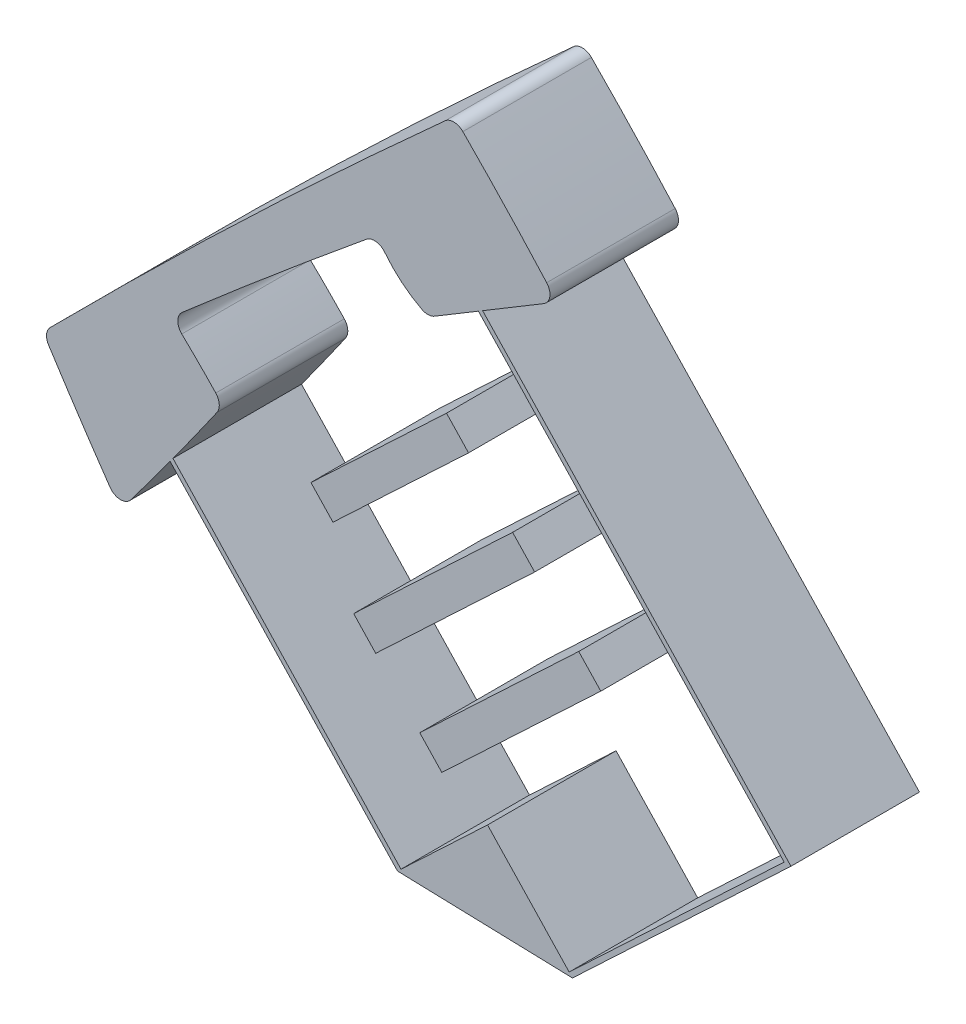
from build123d import *

# Parameters (mm, degrees)
LINEAR_AUSTRAGEN1_DEPTH = 2
LINEAR_AUSTRAGEN2_DEPTH = 2
VERRUNDUNG2_R           = 0.2


with BuildPart() as part:
    # Skizze1 → Linear austragen1 (new body)
    with BuildSketch(Plane.XY):
        with BuildLine():
            Line((6, 5), (8, 6.2))
            ThreePointArc((8, 6.2), (7.212745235, 7.061995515), (6.4, 7.9))
            ThreePointArc((6.4, 7.9), (3.153553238, 4.898731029), (0, 1.8))
            ThreePointArc((0, 1.8), (0.590101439, 0.89340096), (1.2, 0))
            ThreePointArc((1.2, 0), (2.012615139, 1.090825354), (2.8, 2.2))
            ThreePointArc((2.8, 2.2), (2.407312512, 2.607312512), (2, 3))
            ThreePointArc((2, 3), (3.589296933, 4.362685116), (5.2, 5.7))
            ThreePointArc((5.2, 5.7), (5.546608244, 5.288980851), (6, 5))
        make_face()
    extrude(amount=LINEAR_AUSTRAGEN1_DEPTH)

    # Skizze2 → Linear austragen2 (add)
    with BuildSketch(Plane.XY.offset(2)):
        with BuildLine():
            Line((5.516541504, -2.710055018), (8.240080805, -2.790157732))
            Line((8.240080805, -2.790157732), (11.640642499, 0.416089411))
            Line((11.640642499, 0.416089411), (6.742436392, 5.61115121))
            Line((6.742436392, 5.61115121), (6.676600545, 5.571649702))
            Line((6.676600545, 5.571649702), (11.534622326, 0.419207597))
            Line((11.534622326, 0.419207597), (8.188629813, -2.735588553))
            Line((8.188629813, -2.735588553), (6.918362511, -1.388336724))
            Line((6.918362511, -1.388336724), (5.571110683, -2.658604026))
            Line((5.571110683, -2.658604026), (1.262083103, 1.911572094))
            ThreePointArc((1.262083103, 1.911572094), (1.218539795, 1.902057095), (1.174511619, 1.895123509))
            Line((1.174511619, 1.895123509), (5.516541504, -2.710055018))
        make_face()
        Polygon((8.680668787, 1.296020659), (6.20686599, -1.03642435), (5.863859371, -0.672629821), (8.337662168, 1.659815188), align=None)
        Polygon((6.279622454, 3.842582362), (6.622629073, 3.478787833), (4.512620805, 1.489349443), (4.169614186, 1.853143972), align=None)
        Polygon((7.65164893, 2.387404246), (5.177846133, 0.054959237), (4.834839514, 0.418753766), (7.308642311, 2.751198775), align=None)
    extrude(amount=-LINEAR_AUSTRAGEN2_DEPTH)


with BuildPart() as linear_austragen2_piece_1:
    # of the separate pieces the step leaves, piece 1, a body of its own (linear_austragen2_pieces)
    add(part.part.solids().sort_by_distance((0, 1.8, 0))[0])

    # Verrundung2
    verrundung2_edges = [linear_austragen2_piece_1.edges().sort_by_distance(p)[0] for p in [
        (2.8, 2.2, 1),
        (1.2, 0, 1),
        (0, 1.8, 1),
        (6.4, 7.9, 1),
        (8, 6.2, 1),
        (6, 5, 1),
        (5.2, 5.7, 1),
        (2, 3, 1),
    ]]
    fillet(verrundung2_edges, radius=VERRUNDUNG2_R)


with BuildPart() as linear_austragen2_piece_2:
    # of the separate pieces the step leaves, piece 2, a body of its own (linear_austragen2_pieces)
    add(part.part.solids().sort_by_distance((7.65164893, 2.387404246, 2))[0])


with BuildPart() as linear_austragen2_piece_3:
    # of the separate pieces the step leaves, piece 3, a body of its own (linear_austragen2_pieces)
    add(part.part.solids().sort_by_distance((8.680668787, 1.296020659, 2))[0])


with BuildPart() as linear_austragen2_piece_4:
    # of the separate pieces the step leaves, piece 4, a body of its own (linear_austragen2_pieces)
    add(part.part.solids().sort_by_distance((6.279622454, 3.842582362, 2))[0])


solid = Compound([linear_austragen2_piece_1.part, linear_austragen2_piece_2.part, linear_austragen2_piece_3.part, linear_austragen2_piece_4.part])
